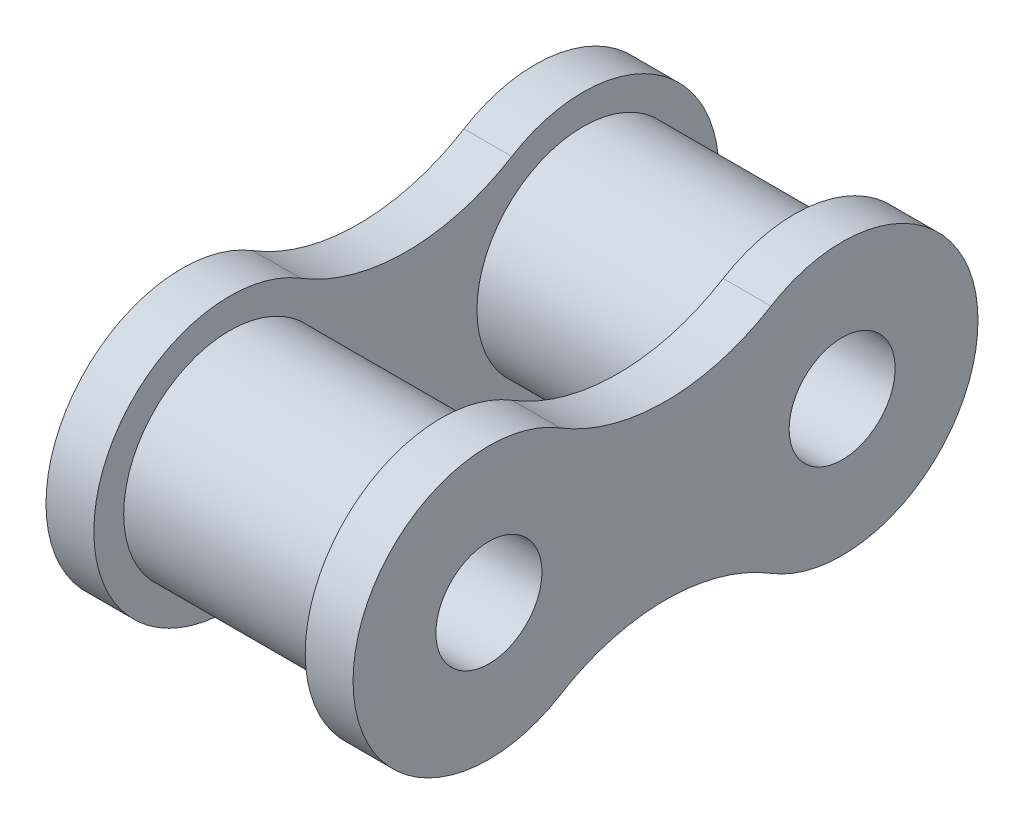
ISO-10303-21;
HEADER;
FILE_DESCRIPTION(('STEP AP214'),'2;1');
FILE_NAME('part.step','',(''),(''),'','','');
FILE_SCHEMA(('AUTOMOTIVE_DESIGN { 1 0 10303 214 1 1 1 1 }'));
ENDSEC;
DATA;
#1=APPLICATION_CONTEXT('core data for automotive mechanical design processes');
#2=APPLICATION_PROTOCOL_DEFINITION('international standard','automotive_design',2000,#1);
#3=PRODUCT_CONTEXT('',#1,'mechanical');
#4=PRODUCT('Part','Part','',(#3));
#5=PRODUCT_RELATED_PRODUCT_CATEGORY('part','',(#4));
#6=PRODUCT_DEFINITION_FORMATION('','',#4);
#7=PRODUCT_DEFINITION_CONTEXT('part definition',#1,'design');
#8=PRODUCT_DEFINITION('design','',#6,#7);
#9=PRODUCT_DEFINITION_SHAPE('','',#8);
#10=(LENGTH_UNIT() NAMED_UNIT(*) SI_UNIT(.MILLI.,.METRE.));
#11=(NAMED_UNIT(*) PLANE_ANGLE_UNIT() SI_UNIT($,.RADIAN.));
#12=(NAMED_UNIT(*) SI_UNIT($,.STERADIAN.) SOLID_ANGLE_UNIT());
#13=UNCERTAINTY_MEASURE_WITH_UNIT(LENGTH_MEASURE(1.E-05),#10,'distance_accuracy_value','');
#14=(GEOMETRIC_REPRESENTATION_CONTEXT(3) GLOBAL_UNCERTAINTY_ASSIGNED_CONTEXT((#13)) GLOBAL_UNIT_ASSIGNED_CONTEXT((#10,
#11,#12)) REPRESENTATION_CONTEXT('',''));
#15=CARTESIAN_POINT('',(0.,0.,0.));
#16=DIRECTION('',(0.,0.,1.));
#17=DIRECTION('',(1.,0.,0.));
#18=AXIS2_PLACEMENT_3D('',#15,#16,#17);
#19=CARTESIAN_POINT('',(0.,-12.9163035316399,-7.93750000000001));
#20=DIRECTION('',(1.,0.,0.));
#21=DIRECTION('',(0.,0.,-1.));
#22=AXIS2_PLACEMENT_3D('',#19,#20,#21);
#23=PLANE('',#22);
#24=CARTESIAN_POINT('',(0.,0.,-31.7499999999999));
#25=DIRECTION('',(1.,0.,0.));
#26=DIRECTION('',(0.,0.,-1.));
#27=AXIS2_PLACEMENT_3D('',#24,#25,#26);
#28=CIRCLE('',#27,9.525);
#29=CARTESIAN_POINT('',(0.,0.,-41.2749999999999));
#30=VERTEX_POINT('',#29);
#31=EDGE_CURVE('E71',#30,#30,#28,.F.);
#32=ORIENTED_EDGE('',*,*,#31,.F.);
#33=EDGE_LOOP('',(#32));
#34=FACE_BOUND('',#33,.T.);
#35=CARTESIAN_POINT('',(0.,-25.8326070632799,-15.875));
#36=DIRECTION('',(-1.,0.,0.));
#37=DIRECTION('',(0.,0.,-1.));
#38=AXIS2_PLACEMENT_3D('',#35,#36,#37);
#39=CIRCLE('',#38,18.1106070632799);
#40=CARTESIAN_POINT('',(0.,-10.4026984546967,-6.39280571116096));
#41=VERTEX_POINT('',#40);
#42=CARTESIAN_POINT('',(0.,-10.4026984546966,-25.357194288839));
#43=VERTEX_POINT('',#42);
#44=EDGE_CURVE('E194',#41,#43,#39,.T.);
#45=ORIENTED_EDGE('',*,*,#44,.F.);
#46=CARTESIAN_POINT('',(0.,0.,0.));
#47=DIRECTION('',(1.,0.,0.));
#48=DIRECTION('',(0.,0.,-1.));
#49=AXIS2_PLACEMENT_3D('',#46,#47,#48);
#50=CIRCLE('',#49,12.2100000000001);
#51=CARTESIAN_POINT('',(0.,10.4026984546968,-6.39280571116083));
#52=VERTEX_POINT('',#51);
#53=EDGE_CURVE('E103',#52,#41,#50,.T.);
#54=ORIENTED_EDGE('',*,*,#53,.F.);
#55=CARTESIAN_POINT('',(0.,25.8326070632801,-15.875));
#56=DIRECTION('',(-1.,0.,0.));
#57=DIRECTION('',(0.,0.,-1.));
#58=AXIS2_PLACEMENT_3D('',#55,#56,#57);
#59=CIRCLE('',#58,18.11060706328);
#60=CARTESIAN_POINT('',(0.,10.4026984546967,-25.3571942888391));
#61=VERTEX_POINT('',#60);
#62=EDGE_CURVE('E97',#61,#52,#59,.T.);
#63=ORIENTED_EDGE('',*,*,#62,.F.);
#64=CARTESIAN_POINT('',(0.,0.,-31.7499999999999));
#65=DIRECTION('',(1.,0.,0.));
#66=DIRECTION('',(0.,0.,-1.));
#67=AXIS2_PLACEMENT_3D('',#64,#65,#66);
#68=CIRCLE('',#67,12.21);
#69=EDGE_CURVE('E204',#43,#61,#68,.T.);
#70=ORIENTED_EDGE('',*,*,#69,.F.);
#71=EDGE_LOOP('',(#45,#54,#63,#70));
#72=FACE_BOUND('',#71,.T.);
#73=CARTESIAN_POINT('',(0.,0.,0.));
#74=DIRECTION('',(1.,0.,0.));
#75=DIRECTION('',(0.,0.,-1.));
#76=AXIS2_PLACEMENT_3D('',#73,#74,#75);
#77=CIRCLE('',#76,9.525);
#78=CARTESIAN_POINT('',(0.,0.,-9.525));
#79=VERTEX_POINT('',#78);
#80=EDGE_CURVE('E12',#79,#79,#77,.F.);
#81=ORIENTED_EDGE('',*,*,#80,.F.);
#82=EDGE_LOOP('',(#81));
#83=FACE_BOUND('',#82,.T.);
#84=ADVANCED_FACE('F62',(#34,#72,#83),#23,.F.);
#85=CARTESIAN_POINT('',(4.3,-12.9163035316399,-7.93750000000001));
#86=DIRECTION('',(1.,0.,0.));
#87=DIRECTION('',(0.,0.,-1.));
#88=AXIS2_PLACEMENT_3D('',#85,#86,#87);
#89=PLANE('',#88);
#90=CARTESIAN_POINT('',(4.3,0.,-31.7499999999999));
#91=DIRECTION('',(1.,0.,0.));
#92=DIRECTION('',(0.,0.,-1.));
#93=AXIS2_PLACEMENT_3D('',#90,#91,#92);
#94=CIRCLE('',#93,4.765);
#95=CARTESIAN_POINT('',(4.3,0.,-26.9849999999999));
#96=VERTEX_POINT('',#95);
#97=EDGE_CURVE('E191',#96,#96,#94,.T.);
#98=ORIENTED_EDGE('',*,*,#97,.F.);
#99=EDGE_LOOP('',(#98));
#100=FACE_BOUND('',#99,.T.);
#101=CARTESIAN_POINT('',(4.3,-25.8326070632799,-15.875));
#102=DIRECTION('',(-1.,0.,0.));
#103=DIRECTION('',(0.,0.,-1.));
#104=AXIS2_PLACEMENT_3D('',#101,#102,#103);
#105=CIRCLE('',#104,18.1106070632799);
#106=CARTESIAN_POINT('',(4.3,-10.4026984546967,-6.39280571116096));
#107=VERTEX_POINT('',#106);
#108=CARTESIAN_POINT('',(4.3,-10.4026984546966,-25.357194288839));
#109=VERTEX_POINT('',#108);
#110=EDGE_CURVE('E195',#107,#109,#105,.T.);
#111=ORIENTED_EDGE('',*,*,#110,.T.);
#112=CARTESIAN_POINT('',(4.3,0.,-31.7499999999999));
#113=DIRECTION('',(1.,0.,0.));
#114=DIRECTION('',(0.,0.,-1.));
#115=AXIS2_PLACEMENT_3D('',#112,#113,#114);
#116=CIRCLE('',#115,12.21);
#117=CARTESIAN_POINT('',(4.3,10.4026984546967,-25.3571942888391));
#118=VERTEX_POINT('',#117);
#119=EDGE_CURVE('E111',#109,#118,#116,.T.);
#120=ORIENTED_EDGE('',*,*,#119,.T.);
#121=CARTESIAN_POINT('',(4.3,25.8326070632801,-15.875));
#122=DIRECTION('',(-1.,0.,0.));
#123=DIRECTION('',(0.,0.,-1.));
#124=AXIS2_PLACEMENT_3D('',#121,#122,#123);
#125=CIRCLE('',#124,18.11060706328);
#126=CARTESIAN_POINT('',(4.3,10.4026984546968,-6.39280571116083));
#127=VERTEX_POINT('',#126);
#128=EDGE_CURVE('E198',#118,#127,#125,.T.);
#129=ORIENTED_EDGE('',*,*,#128,.T.);
#130=CARTESIAN_POINT('',(4.3,0.,0.));
#131=DIRECTION('',(1.,0.,0.));
#132=DIRECTION('',(0.,0.,-1.));
#133=AXIS2_PLACEMENT_3D('',#130,#131,#132);
#134=CIRCLE('',#133,12.2100000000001);
#135=EDGE_CURVE('E79',#127,#107,#134,.T.);
#136=ORIENTED_EDGE('',*,*,#135,.T.);
#137=EDGE_LOOP('',(#111,#120,#129,#136));
#138=FACE_BOUND('',#137,.T.);
#139=CARTESIAN_POINT('',(4.3,0.,0.));
#140=DIRECTION('',(1.,0.,0.));
#141=DIRECTION('',(0.,0.,-1.));
#142=AXIS2_PLACEMENT_3D('',#139,#140,#141);
#143=CIRCLE('',#142,4.765);
#144=CARTESIAN_POINT('',(4.3,0.,4.765));
#145=VERTEX_POINT('',#144);
#146=EDGE_CURVE('E188',#145,#145,#143,.T.);
#147=ORIENTED_EDGE('',*,*,#146,.F.);
#148=EDGE_LOOP('',(#147));
#149=FACE_BOUND('',#148,.T.);
#150=ADVANCED_FACE('F221',(#100,#138,#149),#89,.T.);
#151=CARTESIAN_POINT('',(4.3,-25.8326070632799,-15.875));
#152=DIRECTION('',(-1.,0.,0.));
#153=DIRECTION('',(0.,0.,1.));
#154=AXIS2_PLACEMENT_3D('',#151,#152,#153);
#155=CYLINDRICAL_SURFACE('',#154,18.1106070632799);
#156=ORIENTED_EDGE('',*,*,#44,.T.);
#157=DIRECTION('',(-1.,0.,0.));
#158=VECTOR('',#157,1.);
#159=CARTESIAN_POINT('',(4.3,-10.4026984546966,-25.357194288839));
#160=LINE('',#159,#158);
#161=EDGE_CURVE('E213',#109,#43,#160,.T.);
#162=ORIENTED_EDGE('',*,*,#161,.F.);
#163=ORIENTED_EDGE('',*,*,#110,.F.);
#164=DIRECTION('',(-1.,0.,0.));
#165=VECTOR('',#164,1.);
#166=CARTESIAN_POINT('',(4.3,-10.4026984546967,-6.39280571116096));
#167=LINE('',#166,#165);
#168=EDGE_CURVE('E201',#107,#41,#167,.T.);
#169=ORIENTED_EDGE('',*,*,#168,.T.);
#170=EDGE_LOOP('',(#156,#162,#163,#169));
#171=FACE_BOUND('',#170,.T.);
#172=ADVANCED_FACE('F64',(#171),#155,.F.);
#173=CARTESIAN_POINT('',(4.3,0.,-31.7499999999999));
#174=DIRECTION('',(-1.,0.,0.));
#175=DIRECTION('',(0.,0.,1.));
#176=AXIS2_PLACEMENT_3D('',#173,#174,#175);
#177=CYLINDRICAL_SURFACE('',#176,12.21);
#178=ORIENTED_EDGE('',*,*,#69,.T.);
#179=DIRECTION('',(-1.,0.,0.));
#180=VECTOR('',#179,1.);
#181=CARTESIAN_POINT('',(4.3,10.4026984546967,-25.3571942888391));
#182=LINE('',#181,#180);
#183=EDGE_CURVE('E211',#118,#61,#182,.T.);
#184=ORIENTED_EDGE('',*,*,#183,.F.);
#185=ORIENTED_EDGE('',*,*,#119,.F.);
#186=ORIENTED_EDGE('',*,*,#161,.T.);
#187=EDGE_LOOP('',(#178,#184,#185,#186));
#188=FACE_BOUND('',#187,.T.);
#189=ADVANCED_FACE('F260',(#188),#177,.T.);
#190=CARTESIAN_POINT('',(4.3,25.8326070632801,-15.875));
#191=DIRECTION('',(-1.,0.,0.));
#192=DIRECTION('',(0.,0.,1.));
#193=AXIS2_PLACEMENT_3D('',#190,#191,#192);
#194=CYLINDRICAL_SURFACE('',#193,18.11060706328);
#195=ORIENTED_EDGE('',*,*,#62,.T.);
#196=DIRECTION('',(-1.,0.,0.));
#197=VECTOR('',#196,1.);
#198=CARTESIAN_POINT('',(4.3,10.4026984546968,-6.39280571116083));
#199=LINE('',#198,#197);
#200=EDGE_CURVE('E209',#127,#52,#199,.T.);
#201=ORIENTED_EDGE('',*,*,#200,.F.);
#202=ORIENTED_EDGE('',*,*,#128,.F.);
#203=ORIENTED_EDGE('',*,*,#183,.T.);
#204=EDGE_LOOP('',(#195,#201,#202,#203));
#205=FACE_BOUND('',#204,.T.);
#206=ADVANCED_FACE('F258',(#205),#194,.F.);
#207=CARTESIAN_POINT('',(4.3,0.,0.));
#208=DIRECTION('',(-1.,0.,0.));
#209=DIRECTION('',(0.,0.,1.));
#210=AXIS2_PLACEMENT_3D('',#207,#208,#209);
#211=CYLINDRICAL_SURFACE('',#210,12.2100000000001);
#212=ORIENTED_EDGE('',*,*,#53,.T.);
#213=ORIENTED_EDGE('',*,*,#168,.F.);
#214=ORIENTED_EDGE('',*,*,#135,.F.);
#215=ORIENTED_EDGE('',*,*,#200,.T.);
#216=EDGE_LOOP('',(#212,#213,#214,#215));
#217=FACE_BOUND('',#216,.T.);
#218=ADVANCED_FACE('F251',(#217),#211,.T.);
#219=CARTESIAN_POINT('',(4.3,0.,-31.7499999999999));
#220=DIRECTION('',(-1.,0.,0.));
#221=DIRECTION('',(0.,0.,1.));
#222=AXIS2_PLACEMENT_3D('',#219,#220,#221);
#223=CYLINDRICAL_SURFACE('',#222,4.765);
#224=CARTESIAN_POINT('',(-23.3,0.,-31.7499999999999));
#225=DIRECTION('',(-1.,0.,0.));
#226=DIRECTION('',(0.,0.,1.));
#227=AXIS2_PLACEMENT_3D('',#224,#225,#226);
#228=CIRCLE('',#227,4.765);
#229=CARTESIAN_POINT('',(-23.3,0.,-26.9849999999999));
#230=VERTEX_POINT('',#229);
#231=EDGE_CURVE('E172',#230,#230,#228,.F.);
#232=CARTESIAN_POINT('',(4.3,0.,-26.9849999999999));
#233=CARTESIAN_POINT('',(4.0125,0.,-26.9849999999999));
#234=CARTESIAN_POINT('',(3.725,0.,-26.9849999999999));
#235=CARTESIAN_POINT('',(3.15,0.,-26.9849999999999));
#236=CARTESIAN_POINT('',(2.8625,0.,-26.9849999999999));
#237=CARTESIAN_POINT('',(2.2875,0.,-26.9849999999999));
#238=CARTESIAN_POINT('',(2.,0.,-26.9849999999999));
#239=CARTESIAN_POINT('',(1.425,0.,-26.9849999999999));
#240=CARTESIAN_POINT('',(1.1375,0.,-26.9849999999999));
#241=CARTESIAN_POINT('',(0.5625,0.,-26.9849999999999));
#242=CARTESIAN_POINT('',(0.275,0.,-26.9849999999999));
#243=CARTESIAN_POINT('',(-0.299999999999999,0.,-26.9849999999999));
#244=CARTESIAN_POINT('',(-0.587499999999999,0.,-26.9849999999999));
#245=CARTESIAN_POINT('',(-1.1625,0.,-26.9849999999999));
#246=CARTESIAN_POINT('',(-1.45,0.,-26.9849999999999));
#247=CARTESIAN_POINT('',(-2.025,0.,-26.9849999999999));
#248=CARTESIAN_POINT('',(-2.3125,0.,-26.9849999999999));
#249=CARTESIAN_POINT('',(-2.8875,0.,-26.9849999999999));
#250=CARTESIAN_POINT('',(-3.175,0.,-26.9849999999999));
#251=CARTESIAN_POINT('',(-3.75,0.,-26.9849999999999));
#252=CARTESIAN_POINT('',(-4.0375,0.,-26.9849999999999));
#253=CARTESIAN_POINT('',(-4.6125,0.,-26.9849999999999));
#254=CARTESIAN_POINT('',(-4.9,0.,-26.9849999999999));
#255=CARTESIAN_POINT('',(-5.475,0.,-26.9849999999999));
#256=CARTESIAN_POINT('',(-5.7625,0.,-26.9849999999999));
#257=CARTESIAN_POINT('',(-6.3375,0.,-26.9849999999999));
#258=CARTESIAN_POINT('',(-6.625,0.,-26.9849999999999));
#259=CARTESIAN_POINT('',(-7.2,0.,-26.9849999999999));
#260=CARTESIAN_POINT('',(-7.4875,0.,-26.9849999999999));
#261=CARTESIAN_POINT('',(-8.0625,0.,-26.9849999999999));
#262=CARTESIAN_POINT('',(-8.35,0.,-26.9849999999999));
#263=CARTESIAN_POINT('',(-8.925,0.,-26.9849999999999));
#264=CARTESIAN_POINT('',(-9.2125,0.,-26.9849999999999));
#265=CARTESIAN_POINT('',(-9.7875,0.,-26.9849999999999));
#266=CARTESIAN_POINT('',(-10.075,0.,-26.9849999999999));
#267=CARTESIAN_POINT('',(-10.65,0.,-26.9849999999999));
#268=CARTESIAN_POINT('',(-10.9375,0.,-26.9849999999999));
#269=CARTESIAN_POINT('',(-11.5125,0.,-26.9849999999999));
#270=CARTESIAN_POINT('',(-11.8,0.,-26.9849999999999));
#271=CARTESIAN_POINT('',(-12.375,0.,-26.9849999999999));
#272=CARTESIAN_POINT('',(-12.6625,0.,-26.9849999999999));
#273=CARTESIAN_POINT('',(-13.2375,0.,-26.9849999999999));
#274=CARTESIAN_POINT('',(-13.525,0.,-26.9849999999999));
#275=CARTESIAN_POINT('',(-14.1,0.,-26.9849999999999));
#276=CARTESIAN_POINT('',(-14.3875,0.,-26.9849999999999));
#277=CARTESIAN_POINT('',(-14.9625,0.,-26.9849999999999));
#278=CARTESIAN_POINT('',(-15.25,0.,-26.9849999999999));
#279=CARTESIAN_POINT('',(-15.825,0.,-26.9849999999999));
#280=CARTESIAN_POINT('',(-16.1125,0.,-26.9849999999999));
#281=CARTESIAN_POINT('',(-16.6875,0.,-26.9849999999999));
#282=CARTESIAN_POINT('',(-16.975,0.,-26.9849999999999));
#283=CARTESIAN_POINT('',(-17.55,0.,-26.9849999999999));
#284=CARTESIAN_POINT('',(-17.8375,0.,-26.9849999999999));
#285=CARTESIAN_POINT('',(-18.4125,0.,-26.9849999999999));
#286=CARTESIAN_POINT('',(-18.7,0.,-26.9849999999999));
#287=CARTESIAN_POINT('',(-19.275,0.,-26.9849999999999));
#288=CARTESIAN_POINT('',(-19.5625,0.,-26.9849999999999));
#289=CARTESIAN_POINT('',(-20.1375,0.,-26.9849999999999));
#290=CARTESIAN_POINT('',(-20.425,0.,-26.9849999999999));
#291=CARTESIAN_POINT('',(-21.,0.,-26.9849999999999));
#292=CARTESIAN_POINT('',(-21.2875,0.,-26.9849999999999));
#293=CARTESIAN_POINT('',(-21.8625,0.,-26.9849999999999));
#294=CARTESIAN_POINT('',(-22.15,0.,-26.9849999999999));
#295=CARTESIAN_POINT('',(-22.725,0.,-26.9849999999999));
#296=CARTESIAN_POINT('',(-23.0125,0.,-26.9849999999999));
#297=CARTESIAN_POINT('',(-23.3,0.,-26.9849999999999));
#298=B_SPLINE_CURVE_WITH_KNOTS('',3,(#232,#233,#234,#235,#236,#237,#238,#239,#240,#241,#242,
#243,#244,#245,#246,#247,#248,#249,#250,#251,#252,#253,#254,#255,#256,#257,#258,#259,#260,#261,
#262,#263,#264,#265,#266,#267,#268,#269,#270,#271,#272,#273,#274,#275,#276,#277,#278,#279,#280,
#281,#282,#283,#284,#285,#286,#287,#288,#289,#290,#291,#292,#293,#294,#295,#296,#297),
.UNSPECIFIED.,.F.,.F.,(4,2,2,2,2,2,2,2,2,2,2,2,2,2,2,2,2,2,2,2,2,2,2,2,2,2,2,2,2,2,2,2,4),(0.,
0.8625,1.725,2.5875,3.45,4.3125,5.175,6.0375,6.9,7.7625,8.625,9.4875,10.35,11.2125,12.075,
12.9375,13.8,14.6625,15.525,16.3875,17.25,18.1125,18.975,19.8375,20.7,21.5625,22.425,23.2875,
24.15,25.0125,25.875,26.7375,27.6),.UNSPECIFIED.);
#299=EDGE_CURVE('BSEAM247',#96,#230,#298,.T.);
#300=ORIENTED_EDGE('',*,*,#97,.T.);
#301=ORIENTED_EDGE('',*,*,#231,.F.);
#302=ORIENTED_EDGE('',*,*,#299,.T.);
#303=ORIENTED_EDGE('',*,*,#299,.F.);
#304=EDGE_LOOP('',(#300,#302,#301,#303));
#305=FACE_BOUND('',#304,.T.);
#306=ADVANCED_FACE('F247',(#305),#223,.F.);
#307=CARTESIAN_POINT('',(4.3,0.,0.));
#308=DIRECTION('',(-1.,0.,0.));
#309=DIRECTION('',(0.,0.,1.));
#310=AXIS2_PLACEMENT_3D('',#307,#308,#309);
#311=CYLINDRICAL_SURFACE('',#310,4.765);
#312=CARTESIAN_POINT('',(-23.3,0.,0.));
#313=DIRECTION('',(-1.,0.,0.));
#314=DIRECTION('',(0.,0.,1.));
#315=AXIS2_PLACEMENT_3D('',#312,#313,#314);
#316=CIRCLE('',#315,4.765);
#317=CARTESIAN_POINT('',(-23.3,0.,4.765));
#318=VERTEX_POINT('',#317);
#319=EDGE_CURVE('E274',#318,#318,#316,.T.);
#320=CARTESIAN_POINT('',(4.3,0.,4.765));
#321=CARTESIAN_POINT('',(4.0125,0.,4.765));
#322=CARTESIAN_POINT('',(3.725,0.,4.765));
#323=CARTESIAN_POINT('',(3.15,0.,4.765));
#324=CARTESIAN_POINT('',(2.8625,0.,4.765));
#325=CARTESIAN_POINT('',(2.2875,0.,4.765));
#326=CARTESIAN_POINT('',(2.,0.,4.765));
#327=CARTESIAN_POINT('',(1.425,0.,4.765));
#328=CARTESIAN_POINT('',(1.1375,0.,4.765));
#329=CARTESIAN_POINT('',(0.5625,0.,4.765));
#330=CARTESIAN_POINT('',(0.275,0.,4.765));
#331=CARTESIAN_POINT('',(-0.299999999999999,0.,4.765));
#332=CARTESIAN_POINT('',(-0.587499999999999,0.,4.765));
#333=CARTESIAN_POINT('',(-1.1625,0.,4.765));
#334=CARTESIAN_POINT('',(-1.45,0.,4.765));
#335=CARTESIAN_POINT('',(-2.025,0.,4.765));
#336=CARTESIAN_POINT('',(-2.3125,0.,4.765));
#337=CARTESIAN_POINT('',(-2.8875,0.,4.765));
#338=CARTESIAN_POINT('',(-3.175,0.,4.765));
#339=CARTESIAN_POINT('',(-3.75,0.,4.765));
#340=CARTESIAN_POINT('',(-4.0375,0.,4.765));
#341=CARTESIAN_POINT('',(-4.6125,0.,4.765));
#342=CARTESIAN_POINT('',(-4.9,0.,4.765));
#343=CARTESIAN_POINT('',(-5.475,0.,4.765));
#344=CARTESIAN_POINT('',(-5.7625,0.,4.765));
#345=CARTESIAN_POINT('',(-6.3375,0.,4.765));
#346=CARTESIAN_POINT('',(-6.625,0.,4.765));
#347=CARTESIAN_POINT('',(-7.2,0.,4.765));
#348=CARTESIAN_POINT('',(-7.4875,0.,4.765));
#349=CARTESIAN_POINT('',(-8.0625,0.,4.765));
#350=CARTESIAN_POINT('',(-8.35,0.,4.765));
#351=CARTESIAN_POINT('',(-8.925,0.,4.765));
#352=CARTESIAN_POINT('',(-9.2125,0.,4.765));
#353=CARTESIAN_POINT('',(-9.7875,0.,4.765));
#354=CARTESIAN_POINT('',(-10.075,0.,4.765));
#355=CARTESIAN_POINT('',(-10.65,0.,4.765));
#356=CARTESIAN_POINT('',(-10.9375,0.,4.765));
#357=CARTESIAN_POINT('',(-11.5125,0.,4.765));
#358=CARTESIAN_POINT('',(-11.8,0.,4.765));
#359=CARTESIAN_POINT('',(-12.375,0.,4.765));
#360=CARTESIAN_POINT('',(-12.6625,0.,4.765));
#361=CARTESIAN_POINT('',(-13.2375,0.,4.765));
#362=CARTESIAN_POINT('',(-13.525,0.,4.765));
#363=CARTESIAN_POINT('',(-14.1,0.,4.765));
#364=CARTESIAN_POINT('',(-14.3875,0.,4.765));
#365=CARTESIAN_POINT('',(-14.9625,0.,4.765));
#366=CARTESIAN_POINT('',(-15.25,0.,4.765));
#367=CARTESIAN_POINT('',(-15.825,0.,4.765));
#368=CARTESIAN_POINT('',(-16.1125,0.,4.765));
#369=CARTESIAN_POINT('',(-16.6875,0.,4.765));
#370=CARTESIAN_POINT('',(-16.975,0.,4.765));
#371=CARTESIAN_POINT('',(-17.55,0.,4.765));
#372=CARTESIAN_POINT('',(-17.8375,0.,4.765));
#373=CARTESIAN_POINT('',(-18.4125,0.,4.765));
#374=CARTESIAN_POINT('',(-18.7,0.,4.765));
#375=CARTESIAN_POINT('',(-19.275,0.,4.765));
#376=CARTESIAN_POINT('',(-19.5625,0.,4.765));
#377=CARTESIAN_POINT('',(-20.1375,0.,4.765));
#378=CARTESIAN_POINT('',(-20.425,0.,4.765));
#379=CARTESIAN_POINT('',(-21.,0.,4.765));
#380=CARTESIAN_POINT('',(-21.2875,0.,4.765));
#381=CARTESIAN_POINT('',(-21.8625,0.,4.765));
#382=CARTESIAN_POINT('',(-22.15,0.,4.765));
#383=CARTESIAN_POINT('',(-22.725,0.,4.765));
#384=CARTESIAN_POINT('',(-23.0125,0.,4.765));
#385=CARTESIAN_POINT('',(-23.3,0.,4.765));
#386=B_SPLINE_CURVE_WITH_KNOTS('',3,(#320,#321,#322,#323,#324,#325,#326,#327,#328,#329,#330,
#331,#332,#333,#334,#335,#336,#337,#338,#339,#340,#341,#342,#343,#344,#345,#346,#347,#348,#349,
#350,#351,#352,#353,#354,#355,#356,#357,#358,#359,#360,#361,#362,#363,#364,#365,#366,#367,#368,
#369,#370,#371,#372,#373,#374,#375,#376,#377,#378,#379,#380,#381,#382,#383,#384,#385),
.UNSPECIFIED.,.F.,.F.,(4,2,2,2,2,2,2,2,2,2,2,2,2,2,2,2,2,2,2,2,2,2,2,2,2,2,2,2,2,2,2,2,4),(0.,
0.8625,1.725,2.5875,3.45,4.3125,5.175,6.0375,6.9,7.7625,8.625,9.4875,10.35,11.2125,12.075,
12.9375,13.8,14.6625,15.525,16.3875,17.25,18.1125,18.975,19.8375,20.7,21.5625,22.425,23.2875,
24.15,25.0125,25.875,26.7375,27.6),.UNSPECIFIED.);
#387=EDGE_CURVE('BSEAM238',#145,#318,#386,.T.);
#388=ORIENTED_EDGE('',*,*,#146,.T.);
#389=ORIENTED_EDGE('',*,*,#319,.T.);
#390=ORIENTED_EDGE('',*,*,#387,.T.);
#391=ORIENTED_EDGE('',*,*,#387,.F.);
#392=EDGE_LOOP('',(#388,#390,#389,#391));
#393=FACE_BOUND('',#392,.T.);
#394=ADVANCED_FACE('F238',(#393),#311,.F.);
#395=CARTESIAN_POINT('',(-19.,0.,-31.7499999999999));
#396=DIRECTION('',(1.,0.,0.));
#397=DIRECTION('',(0.,0.,-1.));
#398=AXIS2_PLACEMENT_3D('',#395,#396,#397);
#399=CYLINDRICAL_SURFACE('',#398,9.525);
#400=CARTESIAN_POINT('',(-19.,0.,-31.7499999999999));
#401=DIRECTION('',(-1.,0.,0.));
#402=DIRECTION('',(0.,0.,1.));
#403=AXIS2_PLACEMENT_3D('',#400,#401,#402);
#404=CIRCLE('',#403,9.525);
#405=CARTESIAN_POINT('',(-19.,0.,-22.2249999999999));
#406=VERTEX_POINT('',#405);
#407=EDGE_CURVE('E185',#406,#406,#404,.T.);
#408=ORIENTED_EDGE('',*,*,#407,.F.);
#409=EDGE_LOOP('',(#408));
#410=FACE_BOUND('',#409,.T.);
#411=ORIENTED_EDGE('',*,*,#31,.T.);
#412=EDGE_LOOP('',(#411));
#413=FACE_BOUND('',#412,.T.);
#414=ADVANCED_FACE('F217',(#410,#413),#399,.T.);
#415=CARTESIAN_POINT('',(-19.,0.,0.));
#416=DIRECTION('',(1.,0.,0.));
#417=DIRECTION('',(0.,0.,-1.));
#418=AXIS2_PLACEMENT_3D('',#415,#416,#417);
#419=CYLINDRICAL_SURFACE('',#418,9.525);
#420=CARTESIAN_POINT('',(-19.,0.,0.));
#421=DIRECTION('',(-1.,0.,0.));
#422=DIRECTION('',(0.,0.,1.));
#423=AXIS2_PLACEMENT_3D('',#420,#421,#422);
#424=CIRCLE('',#423,9.525);
#425=CARTESIAN_POINT('',(-19.,0.,9.525));
#426=VERTEX_POINT('',#425);
#427=EDGE_CURVE('E158',#426,#426,#424,.T.);
#428=ORIENTED_EDGE('',*,*,#427,.F.);
#429=EDGE_LOOP('',(#428));
#430=FACE_BOUND('',#429,.T.);
#431=ORIENTED_EDGE('',*,*,#80,.T.);
#432=EDGE_LOOP('',(#431));
#433=FACE_BOUND('',#432,.T.);
#434=ADVANCED_FACE('F227',(#430,#433),#419,.T.);
#435=CARTESIAN_POINT('',(-19.,12.9163035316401,-7.93749999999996));
#436=DIRECTION('',(-1.,0.,0.));
#437=DIRECTION('',(0.,0.,1.));
#438=AXIS2_PLACEMENT_3D('',#435,#436,#437);
#439=PLANE('',#438);
#440=ORIENTED_EDGE('',*,*,#427,.T.);
#441=EDGE_LOOP('',(#440));
#442=FACE_BOUND('',#441,.T.);
#443=CARTESIAN_POINT('',(-19.,0.,0.));
#444=DIRECTION('',(-1.,0.,0.));
#445=DIRECTION('',(0.,0.,1.));
#446=AXIS2_PLACEMENT_3D('',#443,#444,#445);
#447=CIRCLE('',#446,12.2100000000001);
#448=CARTESIAN_POINT('',(-19.,-10.4026984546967,-6.39280571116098));
#449=VERTEX_POINT('',#448);
#450=CARTESIAN_POINT('',(-19.,10.4026984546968,-6.39280571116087));
#451=VERTEX_POINT('',#450);
#452=EDGE_CURVE('E154',#449,#451,#447,.T.);
#453=ORIENTED_EDGE('',*,*,#452,.F.);
#454=CARTESIAN_POINT('',(-19.,-25.8326070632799,-15.8749999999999));
#455=DIRECTION('',(-1.,0.,0.));
#456=DIRECTION('',(0.,0.,1.));
#457=AXIS2_PLACEMENT_3D('',#454,#455,#456);
#458=CIRCLE('',#457,18.1106070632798);
#459=CARTESIAN_POINT('',(-19.,-10.4026984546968,-25.357194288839));
#460=VERTEX_POINT('',#459);
#461=EDGE_CURVE('E148',#449,#460,#458,.T.);
#462=ORIENTED_EDGE('',*,*,#461,.T.);
#463=CARTESIAN_POINT('',(-19.,0.,-31.7499999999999));
#464=DIRECTION('',(-1.,0.,0.));
#465=DIRECTION('',(0.,0.,1.));
#466=AXIS2_PLACEMENT_3D('',#463,#464,#465);
#467=CIRCLE('',#466,12.2100000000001);
#468=CARTESIAN_POINT('',(-19.,10.4026984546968,-25.3571942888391));
#469=VERTEX_POINT('',#468);
#470=EDGE_CURVE('E174',#469,#460,#467,.T.);
#471=ORIENTED_EDGE('',*,*,#470,.F.);
#472=CARTESIAN_POINT('',(-19.,25.8326070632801,-15.8749999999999));
#473=DIRECTION('',(-1.,0.,0.));
#474=DIRECTION('',(0.,0.,1.));
#475=AXIS2_PLACEMENT_3D('',#472,#473,#474);
#476=CIRCLE('',#475,18.11060706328);
#477=EDGE_CURVE('E171',#469,#451,#476,.T.);
#478=ORIENTED_EDGE('',*,*,#477,.T.);
#479=EDGE_LOOP('',(#453,#462,#471,#478));
#480=FACE_BOUND('',#479,.T.);
#481=ORIENTED_EDGE('',*,*,#407,.T.);
#482=EDGE_LOOP('',(#481));
#483=FACE_BOUND('',#482,.T.);
#484=ADVANCED_FACE('F229',(#442,#480,#483),#439,.F.);
#485=CARTESIAN_POINT('',(-23.3,12.9163035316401,-7.93749999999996));
#486=DIRECTION('',(-1.,0.,0.));
#487=DIRECTION('',(0.,0.,1.));
#488=AXIS2_PLACEMENT_3D('',#485,#486,#487);
#489=PLANE('',#488);
#490=CARTESIAN_POINT('',(-23.3,0.,0.));
#491=DIRECTION('',(-1.,0.,0.));
#492=DIRECTION('',(0.,0.,1.));
#493=AXIS2_PLACEMENT_3D('',#490,#491,#492);
#494=CIRCLE('',#493,12.2100000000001);
#495=CARTESIAN_POINT('',(-23.3,-10.4026984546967,-6.39280571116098));
#496=VERTEX_POINT('',#495);
#497=CARTESIAN_POINT('',(-23.3,10.4026984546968,-6.39280571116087));
#498=VERTEX_POINT('',#497);
#499=EDGE_CURVE('E139',#496,#498,#494,.T.);
#500=ORIENTED_EDGE('',*,*,#499,.T.);
#501=CARTESIAN_POINT('',(-23.3,25.8326070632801,-15.8749999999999));
#502=DIRECTION('',(-1.,0.,0.));
#503=DIRECTION('',(0.,0.,1.));
#504=AXIS2_PLACEMENT_3D('',#501,#502,#503);
#505=CIRCLE('',#504,18.11060706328);
#506=CARTESIAN_POINT('',(-23.3,10.4026984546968,-25.3571942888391));
#507=VERTEX_POINT('',#506);
#508=EDGE_CURVE('E144',#507,#498,#505,.T.);
#509=ORIENTED_EDGE('',*,*,#508,.F.);
#510=CARTESIAN_POINT('',(-23.3,0.,-31.7499999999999));
#511=DIRECTION('',(-1.,0.,0.));
#512=DIRECTION('',(0.,0.,1.));
#513=AXIS2_PLACEMENT_3D('',#510,#511,#512);
#514=CIRCLE('',#513,12.2100000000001);
#515=CARTESIAN_POINT('',(-23.3,-10.4026984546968,-25.357194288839));
#516=VERTEX_POINT('',#515);
#517=EDGE_CURVE('E163',#507,#516,#514,.T.);
#518=ORIENTED_EDGE('',*,*,#517,.T.);
#519=CARTESIAN_POINT('',(-23.3,-25.8326070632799,-15.8749999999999));
#520=DIRECTION('',(-1.,0.,0.));
#521=DIRECTION('',(0.,0.,1.));
#522=AXIS2_PLACEMENT_3D('',#519,#520,#521);
#523=CIRCLE('',#522,18.1106070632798);
#524=EDGE_CURVE('E146',#496,#516,#523,.T.);
#525=ORIENTED_EDGE('',*,*,#524,.F.);
#526=EDGE_LOOP('',(#500,#509,#518,#525));
#527=FACE_BOUND('',#526,.T.);
#528=ORIENTED_EDGE('',*,*,#231,.T.);
#529=EDGE_LOOP('',(#528));
#530=FACE_BOUND('',#529,.T.);
#531=ORIENTED_EDGE('',*,*,#319,.F.);
#532=EDGE_LOOP('',(#531));
#533=FACE_BOUND('',#532,.T.);
#534=ADVANCED_FACE('F141',(#527,#530,#533),#489,.T.);
#535=CARTESIAN_POINT('',(-23.3,0.,0.));
#536=DIRECTION('',(1.,0.,0.));
#537=DIRECTION('',(0.,0.,-1.));
#538=AXIS2_PLACEMENT_3D('',#535,#536,#537);
#539=CYLINDRICAL_SURFACE('',#538,12.2100000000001);
#540=ORIENTED_EDGE('',*,*,#452,.T.);
#541=DIRECTION('',(1.,0.,0.));
#542=VECTOR('',#541,1.);
#543=CARTESIAN_POINT('',(-23.3,10.4026984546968,-6.39280571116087));
#544=LINE('',#543,#542);
#545=EDGE_CURVE('E151',#498,#451,#544,.T.);
#546=ORIENTED_EDGE('',*,*,#545,.F.);
#547=ORIENTED_EDGE('',*,*,#499,.F.);
#548=DIRECTION('',(1.,0.,0.));
#549=VECTOR('',#548,1.);
#550=CARTESIAN_POINT('',(-23.3,-10.4026984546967,-6.39280571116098));
#551=LINE('',#550,#549);
#552=EDGE_CURVE('E169',#496,#449,#551,.T.);
#553=ORIENTED_EDGE('',*,*,#552,.T.);
#554=EDGE_LOOP('',(#540,#546,#547,#553));
#555=FACE_BOUND('',#554,.T.);
#556=ADVANCED_FACE('F152',(#555),#539,.T.);
#557=CARTESIAN_POINT('',(-23.3,25.8326070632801,-15.8749999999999));
#558=DIRECTION('',(1.,0.,0.));
#559=DIRECTION('',(0.,0.,-1.));
#560=AXIS2_PLACEMENT_3D('',#557,#558,#559);
#561=CYLINDRICAL_SURFACE('',#560,18.11060706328);
#562=ORIENTED_EDGE('',*,*,#477,.F.);
#563=DIRECTION('',(1.,0.,0.));
#564=VECTOR('',#563,1.);
#565=CARTESIAN_POINT('',(-23.3,10.4026984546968,-25.3571942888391));
#566=LINE('',#565,#564);
#567=EDGE_CURVE('E159',#507,#469,#566,.T.);
#568=ORIENTED_EDGE('',*,*,#567,.F.);
#569=ORIENTED_EDGE('',*,*,#508,.T.);
#570=ORIENTED_EDGE('',*,*,#545,.T.);
#571=EDGE_LOOP('',(#562,#568,#569,#570));
#572=FACE_BOUND('',#571,.T.);
#573=ADVANCED_FACE('F161',(#572),#561,.F.);
#574=CARTESIAN_POINT('',(-23.3,0.,-31.7499999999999));
#575=DIRECTION('',(1.,0.,0.));
#576=DIRECTION('',(0.,0.,-1.));
#577=AXIS2_PLACEMENT_3D('',#574,#575,#576);
#578=CYLINDRICAL_SURFACE('',#577,12.2100000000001);
#579=ORIENTED_EDGE('',*,*,#470,.T.);
#580=DIRECTION('',(1.,0.,0.));
#581=VECTOR('',#580,1.);
#582=CARTESIAN_POINT('',(-23.3,-10.4026984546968,-25.357194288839));
#583=LINE('',#582,#581);
#584=EDGE_CURVE('E180',#516,#460,#583,.T.);
#585=ORIENTED_EDGE('',*,*,#584,.F.);
#586=ORIENTED_EDGE('',*,*,#517,.F.);
#587=ORIENTED_EDGE('',*,*,#567,.T.);
#588=EDGE_LOOP('',(#579,#585,#586,#587));
#589=FACE_BOUND('',#588,.T.);
#590=ADVANCED_FACE('F289',(#589),#578,.T.);
#591=CARTESIAN_POINT('',(-23.3,-25.8326070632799,-15.8749999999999));
#592=DIRECTION('',(1.,0.,0.));
#593=DIRECTION('',(0.,0.,-1.));
#594=AXIS2_PLACEMENT_3D('',#591,#592,#593);
#595=CYLINDRICAL_SURFACE('',#594,18.1106070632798);
#596=ORIENTED_EDGE('',*,*,#461,.F.);
#597=ORIENTED_EDGE('',*,*,#552,.F.);
#598=ORIENTED_EDGE('',*,*,#524,.T.);
#599=ORIENTED_EDGE('',*,*,#584,.T.);
#600=EDGE_LOOP('',(#596,#597,#598,#599));
#601=FACE_BOUND('',#600,.T.);
#602=ADVANCED_FACE('F286',(#601),#595,.F.);
#603=CLOSED_SHELL('',(#84,#150,#172,#189,#206,#218,#306,#394,#414,#434,#484,#534,#556,#573,#590,#602));
#604=MANIFOLD_SOLID_BREP('B2',#603);
#605=ADVANCED_BREP_SHAPE_REPRESENTATION('',(#18,#604),#14);
#606=SHAPE_DEFINITION_REPRESENTATION(#9,#605);
ENDSEC;
END-ISO-10303-21;
